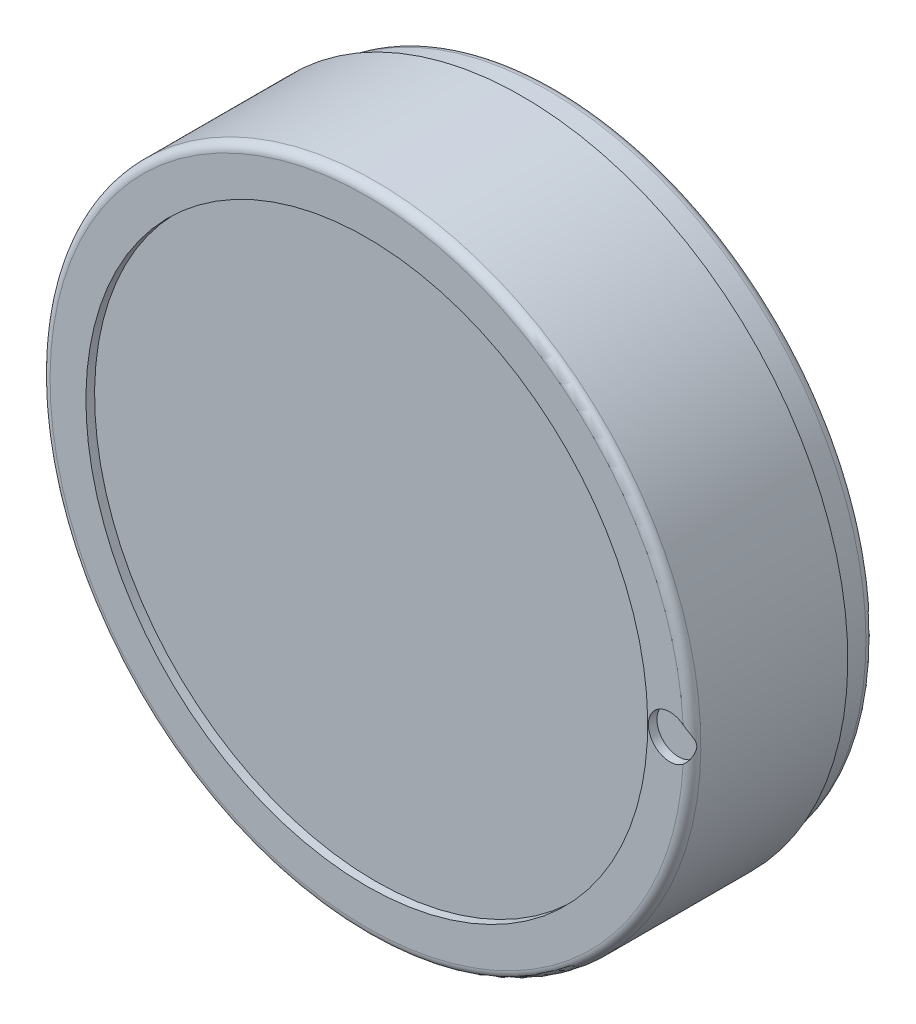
ISO-10303-21;
HEADER;
FILE_DESCRIPTION(('STEP AP214'),'2;1');
FILE_NAME('part.step','',(''),(''),'','','');
FILE_SCHEMA(('AUTOMOTIVE_DESIGN { 1 0 10303 214 1 1 1 1 }'));
ENDSEC;
DATA;
#1=APPLICATION_CONTEXT('core data for automotive mechanical design processes');
#2=APPLICATION_PROTOCOL_DEFINITION('international standard','automotive_design',2000,#1);
#3=PRODUCT_CONTEXT('',#1,'mechanical');
#4=PRODUCT('Part','Part','',(#3));
#5=PRODUCT_RELATED_PRODUCT_CATEGORY('part','',(#4));
#6=PRODUCT_DEFINITION_FORMATION('','',#4);
#7=PRODUCT_DEFINITION_CONTEXT('part definition',#1,'design');
#8=PRODUCT_DEFINITION('design','',#6,#7);
#9=PRODUCT_DEFINITION_SHAPE('','',#8);
#10=(LENGTH_UNIT() NAMED_UNIT(*) SI_UNIT(.MILLI.,.METRE.));
#11=(NAMED_UNIT(*) PLANE_ANGLE_UNIT() SI_UNIT($,.RADIAN.));
#12=(NAMED_UNIT(*) SI_UNIT($,.STERADIAN.) SOLID_ANGLE_UNIT());
#13=UNCERTAINTY_MEASURE_WITH_UNIT(LENGTH_MEASURE(1.E-05),#10,'distance_accuracy_value','');
#14=(GEOMETRIC_REPRESENTATION_CONTEXT(3) GLOBAL_UNCERTAINTY_ASSIGNED_CONTEXT((#13)) GLOBAL_UNIT_ASSIGNED_CONTEXT((#10,
#11,#12)) REPRESENTATION_CONTEXT('',''));
#15=CARTESIAN_POINT('',(0.,0.,0.));
#16=DIRECTION('',(0.,0.,1.));
#17=DIRECTION('',(1.,0.,0.));
#18=AXIS2_PLACEMENT_3D('',#15,#16,#17);
#19=CARTESIAN_POINT('',(0.,0.,22.));
#20=DIRECTION('',(0.,0.,1.));
#21=DIRECTION('',(0.,-1.,0.));
#22=AXIS2_PLACEMENT_3D('',#19,#20,#21);
#23=PLANE('',#22);
#24=CARTESIAN_POINT('',(0.,0.,22.));
#25=DIRECTION('',(0.,0.,1.));
#26=DIRECTION('',(0.,-1.,0.));
#27=AXIS2_PLACEMENT_3D('',#24,#25,#26);
#28=CIRCLE('',#27,32.5);
#29=CARTESIAN_POINT('',(0.,-32.5,22.));
#30=VERTEX_POINT('',#29);
#31=EDGE_CURVE('E124',#30,#30,#28,.T.);
#32=ORIENTED_EDGE('',*,*,#31,.F.);
#33=EDGE_LOOP('',(#32));
#34=FACE_BOUND('',#33,.T.);
#35=CARTESIAN_POINT('',(0.,0.,22.));
#36=DIRECTION('',(0.,0.,1.));
#37=DIRECTION('',(0.,-1.,0.));
#38=AXIS2_PLACEMENT_3D('',#35,#36,#37);
#39=CIRCLE('',#38,36.6499999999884);
#40=CARTESIAN_POINT('',(36.596484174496,1.97986011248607,22.));
#41=VERTEX_POINT('',#40);
#42=CARTESIAN_POINT('',(36.596484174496,-1.97986011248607,22.));
#43=VERTEX_POINT('',#42);
#44=EDGE_CURVE('E160',#41,#43,#39,.T.);
#45=ORIENTED_EDGE('',*,*,#44,.T.);
#46=CARTESIAN_POINT('',(35.07,0.,22.));
#47=DIRECTION('',(0.,0.,1.));
#48=DIRECTION('',(0.,-1.,0.));
#49=AXIS2_PLACEMENT_3D('',#46,#47,#48);
#50=CIRCLE('',#49,2.5);
#51=EDGE_CURVE('E42',#43,#41,#50,.F.);
#52=ORIENTED_EDGE('',*,*,#51,.T.);
#53=EDGE_LOOP('',(#45,#52));
#54=FACE_BOUND('',#53,.T.);
#55=ADVANCED_FACE('F14',(#34,#54),#23,.T.);
#56=CARTESIAN_POINT('',(0.,0.,21.));
#57=DIRECTION('',(0.,0.,1.));
#58=DIRECTION('',(0.,-1.,0.));
#59=AXIS2_PLACEMENT_3D('',#56,#57,#58);
#60=TOROIDAL_SURFACE('',#59,36.6499999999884,0.999999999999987);
#61=CARTESIAN_POINT('',(0.,0.,21.));
#62=DIRECTION('',(0.,0.,1.));
#63=DIRECTION('',(0.,-1.,0.));
#64=AXIS2_PLACEMENT_3D('',#61,#62,#63);
#65=CIRCLE('',#64,37.6499999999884);
#66=CARTESIAN_POINT('',(0.,-37.6499999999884,21.));
#67=VERTEX_POINT('',#66);
#68=EDGE_CURVE('E157',#67,#67,#65,.T.);
#69=ORIENTED_EDGE('',*,*,#68,.T.);
#70=EDGE_LOOP('',(#69));
#71=FACE_BOUND('',#70,.T.);
#72=ORIENTED_EDGE('',*,*,#44,.F.);
#73=CARTESIAN_POINT('',(35.5656886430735,2.45036584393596,20.9998));
#74=CARTESIAN_POINT('',(35.5656830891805,2.45036441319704,21.0268327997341));
#75=CARTESIAN_POINT('',(35.5667927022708,2.45014279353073,21.0538529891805));
#76=CARTESIAN_POINT('',(35.5712286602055,2.44924016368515,21.1077024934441));
#77=CARTESIAN_POINT('',(35.5745549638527,2.44855916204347,21.1345318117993));
#78=CARTESIAN_POINT('',(35.5878267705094,2.44580100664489,21.2144154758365));
#79=CARTESIAN_POINT('',(35.6010652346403,2.44300879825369,21.2669384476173));
#80=CARTESIAN_POINT('',(35.6358946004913,2.43517519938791,21.3689742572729));
#81=CARTESIAN_POINT('',(35.6574913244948,2.4301322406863,21.4184849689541));
#82=CARTESIAN_POINT('',(35.7082565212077,2.41729410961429,21.5130505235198));
#83=CARTESIAN_POINT('',(35.7374215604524,2.40950018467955,21.5581073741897));
#84=CARTESIAN_POINT('',(35.8020378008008,2.39065747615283,21.6423180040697));
#85=CARTESIAN_POINT('',(35.8374568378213,2.37962516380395,21.6815001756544));
#86=CARTESIAN_POINT('',(35.9132468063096,2.35383380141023,21.7532924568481));
#87=CARTESIAN_POINT('',(35.9536181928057,2.33907440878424,21.7859019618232));
#88=CARTESIAN_POINT('',(36.0380877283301,2.30540460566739,21.8443038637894));
#89=CARTESIAN_POINT('',(36.0822191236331,2.28645414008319,21.8700247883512));
#90=CARTESIAN_POINT('',(36.1721479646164,2.24448967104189,21.9141587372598));
#91=CARTESIAN_POINT('',(36.2179457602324,2.22147481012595,21.9325702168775));
#92=CARTESIAN_POINT('',(36.3132353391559,2.16968319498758,21.96360913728));
#93=CARTESIAN_POINT('',(36.3627392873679,2.14059874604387,21.9756801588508));
#94=CARTESIAN_POINT('',(36.4604470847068,2.07846642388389,21.992615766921));
#95=CARTESIAN_POINT('',(36.5086501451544,2.04541620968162,21.9974760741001));
#96=CARTESIAN_POINT('',(36.6270611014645,1.95790844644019,22.0019087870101));
#97=CARTESIAN_POINT('',(36.6957729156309,1.90121196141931,21.997452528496));
#98=CARTESIAN_POINT('',(36.8259522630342,1.78171283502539,21.9777587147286));
#99=CARTESIAN_POINT('',(36.8874031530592,1.71889674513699,21.9624969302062));
#100=CARTESIAN_POINT('',(37.0273939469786,1.56017793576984,21.9157988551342));
#101=CARTESIAN_POINT('',(37.1017074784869,1.46178792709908,21.8802120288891));
#102=CARTESIAN_POINT('',(37.2339286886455,1.25788809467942,21.7996598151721));
#103=CARTESIAN_POINT('',(37.2917848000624,1.15235714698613,21.7546656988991));
#104=CARTESIAN_POINT('',(37.3677118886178,0.987127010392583,21.6835732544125));
#105=CARTESIAN_POINT('',(37.3916162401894,0.929506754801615,21.6586681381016));
#106=CARTESIAN_POINT('',(37.4350713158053,0.812606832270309,21.6089674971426));
#107=CARTESIAN_POINT('',(37.4546231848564,0.753327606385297,21.5841719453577));
#108=CARTESIAN_POINT('',(37.4893131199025,0.633105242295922,21.5361620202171));
#109=CARTESIAN_POINT('',(37.5044663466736,0.572168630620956,21.5129424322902));
#110=CARTESIAN_POINT('',(37.5303161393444,0.448176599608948,21.4701204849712));
#111=CARTESIAN_POINT('',(37.5410185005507,0.385124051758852,21.4505134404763));
#112=CARTESIAN_POINT('',(37.5585924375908,0.249149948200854,21.4165288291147));
#113=CARTESIAN_POINT('',(37.5648988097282,0.175915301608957,21.4029858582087));
#114=CARTESIAN_POINT('',(37.5694238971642,0.0651450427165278,21.393189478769));
#115=CARTESIAN_POINT('',(37.5701145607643,0.0281693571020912,21.3916671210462));
#116=CARTESIAN_POINT('',(37.5698545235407,-0.0457521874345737,21.3922373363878));
#117=CARTESIAN_POINT('',(37.5689036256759,-0.0826980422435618,21.394330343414));
#118=CARTESIAN_POINT('',(37.5636604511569,-0.192252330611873,21.4056182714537));
#119=CARTESIAN_POINT('',(37.5570032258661,-0.26423639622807,21.4197703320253));
#120=CARTESIAN_POINT('',(37.5379108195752,-0.40570987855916,21.456327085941));
#121=CARTESIAN_POINT('',(37.5254228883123,-0.475170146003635,21.4788067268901));
#122=CARTESIAN_POINT('',(37.4942712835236,-0.615057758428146,21.5288377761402));
#123=CARTESIAN_POINT('',(37.4753179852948,-0.685344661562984,21.5565933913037));
#124=CARTESIAN_POINT('',(37.4315596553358,-0.823587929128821,21.6133961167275));
#125=CARTESIAN_POINT('',(37.4067494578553,-0.89154217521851,21.6424443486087));
#126=CARTESIAN_POINT('',(37.3513133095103,-1.02509454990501,21.6998724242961));
#127=CARTESIAN_POINT('',(37.3207030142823,-1.09069846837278,21.7282538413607));
#128=CARTESIAN_POINT('',(37.2535369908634,-1.21960791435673,21.7829882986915));
#129=CARTESIAN_POINT('',(37.2169856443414,-1.28291509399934,21.8093428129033));
#130=CARTESIAN_POINT('',(37.1246961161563,-1.42752068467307,21.8668975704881));
#131=CARTESIAN_POINT('',(37.066607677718,-1.50785744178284,21.8968244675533));
#132=CARTESIAN_POINT('',(36.939571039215,-1.66273591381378,21.9473075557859));
#133=CARTESIAN_POINT('',(36.8706367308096,-1.73728486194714,21.9678756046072));
#134=CARTESIAN_POINT('',(36.741003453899,-1.86109666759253,21.9918916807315));
#135=CARTESIAN_POINT('',(36.6824881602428,-1.91205157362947,21.998316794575));
#136=CARTESIAN_POINT('',(36.5607787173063,-2.00837375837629,22.0011043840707));
#137=CARTESIAN_POINT('',(36.4975918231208,-2.05374942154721,21.9974821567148));
#138=CARTESIAN_POINT('',(36.3812743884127,-2.12941143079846,21.979749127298));
#139=CARTESIAN_POINT('',(36.3286044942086,-2.16091133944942,21.9678367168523));
#140=CARTESIAN_POINT('',(36.2232967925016,-2.21889826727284,21.9349298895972));
#141=CARTESIAN_POINT('',(36.1706589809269,-2.24538743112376,21.9139393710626));
#142=CARTESIAN_POINT('',(36.0673577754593,-2.29315042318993,21.8621310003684));
#143=CARTESIAN_POINT('',(36.0167093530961,-2.31438941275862,21.8312504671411));
#144=CARTESIAN_POINT('',(35.9204260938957,-2.35147644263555,21.7599007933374));
#145=CARTESIAN_POINT('',(35.8747890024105,-2.3673269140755,21.7194359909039));
#146=CARTESIAN_POINT('',(35.7957117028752,-2.39267194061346,21.6349719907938));
#147=CARTESIAN_POINT('',(35.7614801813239,-2.40267637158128,21.5918621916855));
#148=CARTESIAN_POINT('',(35.7004150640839,-2.41941787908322,21.5000964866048));
#149=CARTESIAN_POINT('',(35.6735828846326,-2.42615433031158,21.4514395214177));
#150=CARTESIAN_POINT('',(35.6291877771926,-2.43676299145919,21.351845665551));
#151=CARTESIAN_POINT('',(35.6113351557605,-2.44072659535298,21.301046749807));
#152=CARTESIAN_POINT('',(35.5841576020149,-2.44659731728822,21.197153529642));
#153=CARTESIAN_POINT('',(35.5748185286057,-2.44850784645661,21.1440631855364));
#154=CARTESIAN_POINT('',(35.5684732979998,-2.44980089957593,21.0755169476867));
#155=CARTESIAN_POINT('',(35.5674258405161,-2.45001376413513,21.0603806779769));
#156=CARTESIAN_POINT('',(35.5660329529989,-2.45029639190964,21.0300981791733));
#157=CARTESIAN_POINT('',(35.5656864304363,-2.45036637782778,21.014952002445));
#158=CARTESIAN_POINT('',(35.5656886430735,-2.45036584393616,20.9998));
#159=B_SPLINE_CURVE_WITH_KNOTS('',3,(#73,#74,#75,#76,#77,#78,#79,#80,#81,#82,#83,#84,#85,#86,
#87,#88,#89,#90,#91,#92,#93,#94,#95,#96,#97,#98,#99,#100,#101,#102,#103,#104,#105,#106,#107,
#108,#109,#110,#111,#112,#113,#114,#115,#116,#117,#118,#119,#120,#121,#122,#123,#124,#125,#126,
#127,#128,#129,#130,#131,#132,#133,#134,#135,#136,#137,#138,#139,#140,#141,#142,#143,#144,#145,
#146,#147,#148,#149,#150,#151,#152,#153,#154,#155,#156,#157,#158),.UNSPECIFIED.,.F.,.F.,(4,2,2,
2,2,2,2,2,2,2,2,2,2,2,2,2,2,2,2,2,2,2,2,2,2,2,2,2,2,2,2,2,2,2,2,2,2,2,2,2,2,2,4),(0.,
0.0810489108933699,0.162096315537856,0.323975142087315,0.485966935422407,0.647885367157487,
0.808994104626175,0.970117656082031,1.13285331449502,1.29562334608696,1.47096227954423,
1.6464052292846,1.91247923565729,2.17915175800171,2.56206144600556,2.9461580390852,
3.14753670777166,3.34886233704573,3.54948558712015,3.74984678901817,3.97270970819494,
4.08354588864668,4.194395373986,4.41415083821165,4.63593413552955,4.86935276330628,
5.10297803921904,5.33598147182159,5.56881383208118,5.87852594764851,6.18784455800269,
6.42061560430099,6.65303245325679,6.83982769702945,7.02654280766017,7.21446551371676,
7.4023033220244,7.56931344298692,7.73635550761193,7.89759312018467,8.05856242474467,
8.10407342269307,8.14951342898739),.UNSPECIFIED.);
#160=EDGE_CURVE('E166',#41,#43,#159,.T.);
#161=ORIENTED_EDGE('',*,*,#160,.T.);
#162=EDGE_LOOP('',(#72,#161));
#163=FACE_BOUND('',#162,.T.);
#164=ADVANCED_FACE('F180',(#71,#163),#60,.T.);
#165=CARTESIAN_POINT('',(0.,0.,34.9460135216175));
#166=DIRECTION('',(0.,0.,1.));
#167=DIRECTION('',(0.,-1.,0.));
#168=AXIS2_PLACEMENT_3D('',#165,#166,#167);
#169=CYLINDRICAL_SURFACE('',#168,37.6499999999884);
#170=CARTESIAN_POINT('',(0.,0.,4.));
#171=DIRECTION('',(0.,0.,1.));
#172=DIRECTION('',(0.,-1.,0.));
#173=AXIS2_PLACEMENT_3D('',#170,#171,#172);
#174=CIRCLE('',#173,37.6499999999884);
#175=CARTESIAN_POINT('',(0.,-37.6499999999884,4.));
#176=VERTEX_POINT('',#175);
#177=EDGE_CURVE('E154',#176,#176,#174,.T.);
#178=ORIENTED_EDGE('',*,*,#177,.T.);
#179=EDGE_LOOP('',(#178));
#180=FACE_BOUND('',#179,.T.);
#181=ORIENTED_EDGE('',*,*,#68,.F.);
#182=EDGE_LOOP('',(#181));
#183=FACE_BOUND('',#182,.T.);
#184=ADVANCED_FACE('F274',(#180,#183),#169,.T.);
#185=CARTESIAN_POINT('',(-37.6499999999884,0.,4.));
#186=DIRECTION('',(0.,0.,-1.));
#187=DIRECTION('',(0.,1.,0.));
#188=AXIS2_PLACEMENT_3D('',#185,#186,#187);
#189=PLANE('',#188);
#190=CARTESIAN_POINT('',(0.,0.,4.));
#191=DIRECTION('',(0.,0.,1.));
#192=DIRECTION('',(0.,-1.,0.));
#193=AXIS2_PLACEMENT_3D('',#190,#191,#192);
#194=CIRCLE('',#193,36.75);
#195=CARTESIAN_POINT('',(0.,-36.75,4.));
#196=VERTEX_POINT('',#195);
#197=EDGE_CURVE('E151',#196,#196,#194,.T.);
#198=ORIENTED_EDGE('',*,*,#197,.T.);
#199=EDGE_LOOP('',(#198));
#200=FACE_BOUND('',#199,.T.);
#201=ORIENTED_EDGE('',*,*,#177,.F.);
#202=EDGE_LOOP('',(#201));
#203=FACE_BOUND('',#202,.T.);
#204=ADVANCED_FACE('F380',(#200,#203),#189,.T.);
#205=CARTESIAN_POINT('',(0.,0.,34.9460135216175));
#206=DIRECTION('',(0.,0.,1.));
#207=DIRECTION('',(0.,-1.,0.));
#208=AXIS2_PLACEMENT_3D('',#205,#206,#207);
#209=CYLINDRICAL_SURFACE('',#208,36.75);
#210=ORIENTED_EDGE('',*,*,#197,.F.);
#211=EDGE_LOOP('',(#210));
#212=FACE_BOUND('',#211,.T.);
#213=CARTESIAN_POINT('',(0.,0.,1.));
#214=DIRECTION('',(0.,0.,1.));
#215=DIRECTION('',(0.,-1.,0.));
#216=AXIS2_PLACEMENT_3D('',#213,#214,#215);
#217=CIRCLE('',#216,36.75);
#218=CARTESIAN_POINT('',(0.,-36.75,1.));
#219=VERTEX_POINT('',#218);
#220=EDGE_CURVE('E148',#219,#219,#217,.T.);
#221=ORIENTED_EDGE('',*,*,#220,.T.);
#222=EDGE_LOOP('',(#221));
#223=FACE_BOUND('',#222,.T.);
#224=ADVANCED_FACE('F387',(#212,#223),#209,.T.);
#225=CARTESIAN_POINT('',(0.,0.,1.));
#226=DIRECTION('',(0.,0.,1.));
#227=DIRECTION('',(0.,-1.,0.));
#228=AXIS2_PLACEMENT_3D('',#225,#226,#227);
#229=TOROIDAL_SURFACE('',#228,35.75,1.);
#230=CARTESIAN_POINT('',(0.,0.,0.));
#231=DIRECTION('',(0.,0.,1.));
#232=DIRECTION('',(0.,-1.,0.));
#233=AXIS2_PLACEMENT_3D('',#230,#231,#232);
#234=CIRCLE('',#233,35.75);
#235=CARTESIAN_POINT('',(0.,-35.75,0.));
#236=VERTEX_POINT('',#235);
#237=EDGE_CURVE('E145',#236,#236,#234,.T.);
#238=ORIENTED_EDGE('',*,*,#237,.T.);
#239=EDGE_LOOP('',(#238));
#240=FACE_BOUND('',#239,.T.);
#241=ORIENTED_EDGE('',*,*,#220,.F.);
#242=EDGE_LOOP('',(#241));
#243=FACE_BOUND('',#242,.T.);
#244=ADVANCED_FACE('F396',(#240,#243),#229,.T.);
#245=CARTESIAN_POINT('',(-35.75,0.,0.));
#246=DIRECTION('',(0.,0.,-1.));
#247=DIRECTION('',(0.,1.,0.));
#248=AXIS2_PLACEMENT_3D('',#245,#246,#247);
#249=PLANE('',#248);
#250=CARTESIAN_POINT('',(0.,0.,0.));
#251=DIRECTION('',(0.,0.,1.));
#252=DIRECTION('',(0.,-1.,0.));
#253=AXIS2_PLACEMENT_3D('',#250,#251,#252);
#254=CIRCLE('',#253,4.50000000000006);
#255=CARTESIAN_POINT('',(0.,-4.50000000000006,0.));
#256=VERTEX_POINT('',#255);
#257=EDGE_CURVE('E142',#256,#256,#254,.T.);
#258=ORIENTED_EDGE('',*,*,#257,.T.);
#259=EDGE_LOOP('',(#258));
#260=FACE_BOUND('',#259,.T.);
#261=ORIENTED_EDGE('',*,*,#237,.F.);
#262=EDGE_LOOP('',(#261));
#263=FACE_BOUND('',#262,.T.);
#264=ADVANCED_FACE('F405',(#260,#263),#249,.T.);
#265=CARTESIAN_POINT('',(0.,0.,34.9460135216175));
#266=DIRECTION('',(0.,0.,1.));
#267=DIRECTION('',(0.,-1.,0.));
#268=AXIS2_PLACEMENT_3D('',#265,#266,#267);
#269=CYLINDRICAL_SURFACE('',#268,4.50000000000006);
#270=CARTESIAN_POINT('',(0.,0.,-0.5));
#271=DIRECTION('',(0.,0.,1.));
#272=DIRECTION('',(0.,-1.,0.));
#273=AXIS2_PLACEMENT_3D('',#270,#271,#272);
#274=CIRCLE('',#273,4.50000000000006);
#275=CARTESIAN_POINT('',(0.,-4.50000000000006,-0.5));
#276=VERTEX_POINT('',#275);
#277=EDGE_CURVE('E139',#276,#276,#274,.T.);
#278=ORIENTED_EDGE('',*,*,#277,.T.);
#279=EDGE_LOOP('',(#278));
#280=FACE_BOUND('',#279,.T.);
#281=ORIENTED_EDGE('',*,*,#257,.F.);
#282=EDGE_LOOP('',(#281));
#283=FACE_BOUND('',#282,.T.);
#284=ADVANCED_FACE('F414',(#280,#283),#269,.T.);
#285=CARTESIAN_POINT('',(-4.04160091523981,0.,-0.5));
#286=DIRECTION('',(0.,0.,1.));
#287=DIRECTION('',(0.,-1.,0.));
#288=AXIS2_PLACEMENT_3D('',#285,#286,#287);
#289=PLANE('',#288);
#290=ORIENTED_EDGE('',*,*,#277,.F.);
#291=EDGE_LOOP('',(#290));
#292=FACE_BOUND('',#291,.T.);
#293=DIRECTION('',(0.5,0.866025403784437,0.));
#294=VECTOR('',#293,1.);
#295=CARTESIAN_POINT('',(2.0207374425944,-3.50001991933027,-0.5));
#296=LINE('',#295,#294);
#297=CARTESIAN_POINT('',(2.0207374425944,-3.50001991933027,-0.5));
#298=VERTEX_POINT('',#297);
#299=CARTESIAN_POINT('',(4.0414748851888,0.,-0.5));
#300=VERTEX_POINT('',#299);
#301=EDGE_CURVE('E97',#298,#300,#296,.T.);
#302=ORIENTED_EDGE('',*,*,#301,.T.);
#303=DIRECTION('',(0.5,-0.866025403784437,0.));
#304=VECTOR('',#303,1.);
#305=CARTESIAN_POINT('',(2.0207374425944,3.50001991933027,-0.5));
#306=LINE('',#305,#304);
#307=CARTESIAN_POINT('',(2.0207374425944,3.50001991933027,-0.5));
#308=VERTEX_POINT('',#307);
#309=EDGE_CURVE('E80',#308,#300,#306,.T.);
#310=ORIENTED_EDGE('',*,*,#309,.F.);
#311=DIRECTION('',(-1.,0.,0.));
#312=VECTOR('',#311,1.);
#313=CARTESIAN_POINT('',(2.0207374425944,3.50001991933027,-0.5));
#314=LINE('',#313,#312);
#315=CARTESIAN_POINT('',(-2.0207374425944,3.50001991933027,-0.5));
#316=VERTEX_POINT('',#315);
#317=EDGE_CURVE('E93',#308,#316,#314,.T.);
#318=ORIENTED_EDGE('',*,*,#317,.T.);
#319=DIRECTION('',(-0.5,-0.866025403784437,0.));
#320=VECTOR('',#319,1.);
#321=CARTESIAN_POINT('',(-2.0207374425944,3.50001991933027,-0.5));
#322=LINE('',#321,#320);
#323=CARTESIAN_POINT('',(-4.0414748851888,0.,-0.5));
#324=VERTEX_POINT('',#323);
#325=EDGE_CURVE('E101',#316,#324,#322,.T.);
#326=ORIENTED_EDGE('',*,*,#325,.T.);
#327=DIRECTION('',(-0.5,0.866025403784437,0.));
#328=VECTOR('',#327,1.);
#329=CARTESIAN_POINT('',(-2.0207374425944,-3.50001991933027,-0.5));
#330=LINE('',#329,#328);
#331=CARTESIAN_POINT('',(-2.0207374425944,-3.50001991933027,-0.5));
#332=VERTEX_POINT('',#331);
#333=EDGE_CURVE('E103',#332,#324,#330,.T.);
#334=ORIENTED_EDGE('',*,*,#333,.F.);
#335=DIRECTION('',(-1.,0.,0.));
#336=VECTOR('',#335,1.);
#337=CARTESIAN_POINT('',(2.0207374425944,-3.50001991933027,-0.5));
#338=LINE('',#337,#336);
#339=EDGE_CURVE('E109',#298,#332,#338,.T.);
#340=ORIENTED_EDGE('',*,*,#339,.F.);
#341=EDGE_LOOP('',(#302,#310,#318,#326,#334,#340));
#342=FACE_BOUND('',#341,.T.);
#343=ADVANCED_FACE('F91',(#292,#342),#289,.F.);
#344=CARTESIAN_POINT('',(0.,0.,21.));
#345=DIRECTION('',(0.,0.,1.));
#346=DIRECTION('',(0.,-1.,0.));
#347=AXIS2_PLACEMENT_3D('',#344,#345,#346);
#348=CYLINDRICAL_SURFACE('',#347,32.5);
#349=CARTESIAN_POINT('',(0.,0.,21.));
#350=DIRECTION('',(0.,0.,1.));
#351=DIRECTION('',(0.,-1.,0.));
#352=AXIS2_PLACEMENT_3D('',#349,#350,#351);
#353=CIRCLE('',#352,32.5);
#354=CARTESIAN_POINT('',(0.,-32.5,21.));
#355=VERTEX_POINT('',#354);
#356=EDGE_CURVE('E127',#355,#355,#353,.T.);
#357=ORIENTED_EDGE('',*,*,#356,.F.);
#358=EDGE_LOOP('',(#357));
#359=FACE_BOUND('',#358,.T.);
#360=ORIENTED_EDGE('',*,*,#31,.T.);
#361=EDGE_LOOP('',(#360));
#362=FACE_BOUND('',#361,.T.);
#363=ADVANCED_FACE('F191',(#359,#362),#348,.F.);
#364=CARTESIAN_POINT('',(0.,0.,21.));
#365=DIRECTION('',(0.,0.,1.));
#366=DIRECTION('',(0.,-1.,0.));
#367=AXIS2_PLACEMENT_3D('',#364,#365,#366);
#368=PLANE('',#367);
#369=ORIENTED_EDGE('',*,*,#356,.T.);
#370=EDGE_LOOP('',(#369));
#371=FACE_BOUND('',#370,.T.);
#372=ADVANCED_FACE('F190',(#371),#368,.T.);
#373=CARTESIAN_POINT('',(35.07,0.,31.));
#374=DIRECTION('',(0.,0.,-1.));
#375=DIRECTION('',(0.,1.,0.));
#376=AXIS2_PLACEMENT_3D('',#373,#374,#375);
#377=CYLINDRICAL_SURFACE('',#376,2.5);
#378=ORIENTED_EDGE('',*,*,#160,.F.);
#379=ORIENTED_EDGE('',*,*,#51,.F.);
#380=EDGE_LOOP('',(#378,#379));
#381=FACE_BOUND('',#380,.T.);
#382=CARTESIAN_POINT('',(35.07,0.,21.));
#383=DIRECTION('',(0.,0.,1.));
#384=DIRECTION('',(0.,-1.,0.));
#385=AXIS2_PLACEMENT_3D('',#382,#383,#384);
#386=CIRCLE('',#385,2.5);
#387=CARTESIAN_POINT('',(35.07,-2.5,21.));
#388=VERTEX_POINT('',#387);
#389=EDGE_CURVE('E120',#388,#388,#386,.T.);
#390=ORIENTED_EDGE('',*,*,#389,.F.);
#391=EDGE_LOOP('',(#390));
#392=FACE_BOUND('',#391,.T.);
#393=ADVANCED_FACE('F184',(#381,#392),#377,.F.);
#394=CARTESIAN_POINT('',(35.07,0.,21.));
#395=DIRECTION('',(0.,0.,1.));
#396=DIRECTION('',(0.,-1.,0.));
#397=AXIS2_PLACEMENT_3D('',#394,#395,#396);
#398=PLANE('',#397);
#399=ORIENTED_EDGE('',*,*,#389,.T.);
#400=EDGE_LOOP('',(#399));
#401=FACE_BOUND('',#400,.T.);
#402=ADVANCED_FACE('F189',(#401),#398,.T.);
#403=CARTESIAN_POINT('',(2.0207374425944,-3.50001991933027,-10.5));
#404=DIRECTION('',(0.866025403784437,-0.5,0.));
#405=DIRECTION('',(-0.5,-0.866025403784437,0.));
#406=AXIS2_PLACEMENT_3D('',#403,#404,#405);
#407=PLANE('',#406);
#408=DIRECTION('',(0.,0.,1.));
#409=VECTOR('',#408,1.);
#410=CARTESIAN_POINT('',(4.0414748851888,0.,-10.5));
#411=LINE('',#410,#409);
#412=CARTESIAN_POINT('',(4.0414748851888,0.,-2.52877022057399));
#413=VERTEX_POINT('',#412);
#414=EDGE_CURVE('E35',#413,#300,#411,.T.);
#415=ORIENTED_EDGE('',*,*,#414,.T.);
#416=ORIENTED_EDGE('',*,*,#301,.F.);
#417=DIRECTION('',(0.,0.,1.));
#418=VECTOR('',#417,1.);
#419=CARTESIAN_POINT('',(2.0207374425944,-3.50001991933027,-10.5));
#420=LINE('',#419,#418);
#421=CARTESIAN_POINT('',(2.0207374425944,-3.50001991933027,-2.52877022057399));
#422=VERTEX_POINT('',#421);
#423=EDGE_CURVE('E118',#422,#298,#420,.T.);
#424=ORIENTED_EDGE('',*,*,#423,.F.);
#425=CARTESIAN_POINT('',(4.04159035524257,0.000199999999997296,-2.52870356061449));
#426=CARTESIAN_POINT('',(3.95279035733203,-0.15360610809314,-2.57998412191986));
#427=CARTESIAN_POINT('',(3.86322406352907,-0.308739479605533,-2.62662187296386));
#428=CARTESIAN_POINT('',(3.68254099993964,-0.621691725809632,-2.70802866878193));
#429=CARTESIAN_POINT('',(3.59142102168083,-0.77951615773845,-2.74276892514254));
#430=CARTESIAN_POINT('',(3.41031000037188,-1.09320964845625,-2.79684791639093));
#431=CARTESIAN_POINT('',(3.3203468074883,-1.24903046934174,-2.81654645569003));
#432=CARTESIAN_POINT('',(3.13999719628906,-1.56140515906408,-2.84006339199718));
#433=CARTESIAN_POINT('',(3.04961143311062,-1.71795789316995,-2.8439012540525));
#434=CARTESIAN_POINT('',(2.88071728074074,-2.01049114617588,-2.83592174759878));
#435=CARTESIAN_POINT('',(2.8021836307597,-2.14651541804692,-2.82606363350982));
#436=CARTESIAN_POINT('',(2.64562782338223,-2.41767803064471,-2.79481768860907));
#437=CARTESIAN_POINT('',(2.56760620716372,-2.55281543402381,-2.77341918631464));
#438=CARTESIAN_POINT('',(2.41072766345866,-2.82453704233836,-2.71992400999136));
#439=CARTESIAN_POINT('',(2.33189058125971,-2.96108687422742,-2.68760061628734));
#440=CARTESIAN_POINT('',(2.17539195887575,-3.23215043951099,-2.6142387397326));
#441=CARTESIAN_POINT('',(2.09772841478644,-3.36666764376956,-2.57321749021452));
#442=CARTESIAN_POINT('',(2.0206219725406,-3.50021991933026,-2.52870356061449));
#443=B_SPLINE_CURVE_WITH_KNOTS('',3,(#425,#426,#427,#428,#429,#430,#431,#432,#433,#434,#435,
#436,#437,#438,#439,#440,#441,#442),.UNSPECIFIED.,.F.,.F.,(4,2,2,2,2,2,2,2,4),(0.,
0.554783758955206,1.11090059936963,1.6532577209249,2.19494903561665,2.6666293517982,
3.13874658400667,3.62133350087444,4.10297304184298),.UNSPECIFIED.);
#444=EDGE_CURVE('E9',#413,#422,#443,.T.);
#445=ORIENTED_EDGE('',*,*,#444,.F.);
#446=EDGE_LOOP('',(#415,#416,#424,#445));
#447=FACE_BOUND('',#446,.T.);
#448=ADVANCED_FACE('F245',(#447),#407,.T.);
#449=CARTESIAN_POINT('',(2.0207374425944,-3.50001991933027,-10.5));
#450=DIRECTION('',(0.,1.,0.));
#451=DIRECTION('',(0.,0.,1.));
#452=AXIS2_PLACEMENT_3D('',#449,#450,#451);
#453=PLANE('',#452);
#454=CARTESIAN_POINT('',(-5.3512905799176,-3.50001991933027,-1.170588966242));
#455=CARTESIAN_POINT('',(-5.19768019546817,-3.50001991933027,-1.244778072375));
#456=CARTESIAN_POINT('',(-5.04370579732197,-3.50001991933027,-1.31822716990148));
#457=CARTESIAN_POINT('',(-4.73483211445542,-3.50001991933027,-1.46322230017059));
#458=CARTESIAN_POINT('',(-4.57993267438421,-3.50001991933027,-1.53476800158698));
#459=CARTESIAN_POINT('',(-4.26817155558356,-3.50001991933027,-1.67591184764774));
#460=CARTESIAN_POINT('',(-4.11130371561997,-3.50001991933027,-1.74549643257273));
#461=CARTESIAN_POINT('',(-3.79627605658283,-3.50001991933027,-1.88166504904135));
#462=CARTESIAN_POINT('',(-3.63811630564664,-3.50001991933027,-1.94824923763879));
#463=CARTESIAN_POINT('',(-3.31832834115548,-3.50001991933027,-2.07839366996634));
#464=CARTESIAN_POINT('',(-3.15668129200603,-3.50001991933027,-2.14190788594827));
#465=CARTESIAN_POINT('',(-2.83147819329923,-3.50001991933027,-2.26394169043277));
#466=CARTESIAN_POINT('',(-2.66792193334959,-3.50001991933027,-2.3224607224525));
#467=CARTESIAN_POINT('',(-2.33897882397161,-3.50001991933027,-2.43292598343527));
#468=CARTESIAN_POINT('',(-2.17359673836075,-3.50001991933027,-2.48488625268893));
#469=CARTESIAN_POINT('',(-1.84048250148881,-3.50001991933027,-2.58054136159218));
#470=CARTESIAN_POINT('',(-1.67275111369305,-3.50001991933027,-2.62423882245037));
#471=CARTESIAN_POINT('',(-1.3348205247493,-3.50001991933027,-2.70124276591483));
#472=CARTESIAN_POINT('',(-1.16462058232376,-3.50001991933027,-2.73454605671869));
#473=CARTESIAN_POINT('',(-0.82217825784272,-3.50001991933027,-2.78851273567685));
#474=CARTESIAN_POINT('',(-0.649935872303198,-3.50001991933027,-2.80917610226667));
#475=CARTESIAN_POINT('',(-0.30539419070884,-3.50001991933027,-2.83603499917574));
#476=CARTESIAN_POINT('',(-0.133102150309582,-3.50001991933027,-2.84232124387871));
#477=CARTESIAN_POINT('',(0.211348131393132,-3.50001991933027,-2.8400954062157));
#478=CARTESIAN_POINT('',(0.383506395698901,-3.50001991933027,-2.83158712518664));
#479=CARTESIAN_POINT('',(0.677767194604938,-3.50001991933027,-2.80499703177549));
#480=CARTESIAN_POINT('',(0.80019463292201,-3.50001991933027,-2.79032195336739));
#481=CARTESIAN_POINT('',(1.04409849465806,-3.50001991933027,-2.75444891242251));
#482=CARTESIAN_POINT('',(1.16557476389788,-3.50001991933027,-2.7332499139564));
#483=CARTESIAN_POINT('',(1.52848072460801,-3.50001991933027,-2.66098055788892));
#484=CARTESIAN_POINT('',(1.76820324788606,-3.50001991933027,-2.60125663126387));
#485=CARTESIAN_POINT('',(2.12689599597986,-3.50001991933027,-2.49831685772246));
#486=CARTESIAN_POINT('',(2.24773740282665,-3.50001991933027,-2.46125595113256));
#487=CARTESIAN_POINT('',(2.48815890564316,-3.50001991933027,-2.38348396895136));
#488=CARTESIAN_POINT('',(2.60773981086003,-3.50001991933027,-2.34277541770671));
#489=CARTESIAN_POINT('',(2.84514008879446,-3.50001991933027,-2.25855396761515));
#490=CARTESIAN_POINT('',(2.96296559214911,-3.50001991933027,-2.21505817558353));
#491=CARTESIAN_POINT('',(3.19770407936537,-3.50001991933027,-2.12552475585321));
#492=CARTESIAN_POINT('',(3.31461666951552,-3.50001991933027,-2.07948609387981));
#493=CARTESIAN_POINT('',(3.43110737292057,-3.50001991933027,-2.032427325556));
#494=B_SPLINE_CURVE_WITH_KNOTS('',3,(#454,#455,#456,#457,#458,#459,#460,#461,#462,#463,#464,
#465,#466,#467,#468,#469,#470,#471,#472,#473,#474,#475,#476,#477,#478,#479,#480,#481,#482,#483,
#484,#485,#486,#487,#488,#489,#490,#491,#492,#493),.UNSPECIFIED.,.F.,.F.,(4,2,2,2,2,2,2,2,2,2,2,
2,2,2,2,2,2,2,2,4),(0.,0.511770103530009,1.02362871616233,1.53842973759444,2.05320378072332,
2.57417206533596,3.0951983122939,3.61508957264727,4.13481563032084,4.65470112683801,
5.17458751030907,5.69118444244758,6.20764865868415,6.57737942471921,6.94716893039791,
7.68730127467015,8.06646189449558,8.44536211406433,8.82212587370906,9.19904402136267),.UNSPECIFIED.);
#495=CARTESIAN_POINT('',(-2.0207374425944,-3.50001991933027,-2.52877022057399));
#496=VERTEX_POINT('',#495);
#497=EDGE_CURVE('E28',#496,#422,#494,.T.);
#498=ORIENTED_EDGE('',*,*,#497,.T.);
#499=ORIENTED_EDGE('',*,*,#423,.T.);
#500=ORIENTED_EDGE('',*,*,#339,.T.);
#501=DIRECTION('',(0.,0.,1.));
#502=VECTOR('',#501,1.);
#503=CARTESIAN_POINT('',(-2.0207374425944,-3.50001991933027,-10.5));
#504=LINE('',#503,#502);
#505=EDGE_CURVE('E116',#496,#332,#504,.T.);
#506=ORIENTED_EDGE('',*,*,#505,.F.);
#507=EDGE_LOOP('',(#498,#499,#500,#506));
#508=FACE_BOUND('',#507,.T.);
#509=ADVANCED_FACE('F241',(#508),#453,.F.);
#510=CARTESIAN_POINT('',(-2.0207374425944,-3.50001991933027,-10.5));
#511=DIRECTION('',(0.866025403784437,0.5,0.));
#512=DIRECTION('',(0.5,-0.866025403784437,0.));
#513=AXIS2_PLACEMENT_3D('',#510,#511,#512);
#514=PLANE('',#513);
#515=CARTESIAN_POINT('',(-4.04159035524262,0.000199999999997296,-2.52870356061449));
#516=CARTESIAN_POINT('',(-3.95279035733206,-0.153606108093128,-2.57998412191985));
#517=CARTESIAN_POINT('',(-3.86322406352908,-0.308739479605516,-2.62662187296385));
#518=CARTESIAN_POINT('',(-3.68254099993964,-0.621691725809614,-2.70802866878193));
#519=CARTESIAN_POINT('',(-3.59142102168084,-0.779516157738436,-2.74276892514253));
#520=CARTESIAN_POINT('',(-3.41031000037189,-1.09320964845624,-2.79684791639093));
#521=CARTESIAN_POINT('',(-3.32034680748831,-1.24903046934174,-2.81654645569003));
#522=CARTESIAN_POINT('',(-3.13999719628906,-1.56140515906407,-2.84006339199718));
#523=CARTESIAN_POINT('',(-3.04961143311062,-1.71795789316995,-2.8439012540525));
#524=CARTESIAN_POINT('',(-2.88071728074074,-2.01049114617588,-2.83592174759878));
#525=CARTESIAN_POINT('',(-2.80218363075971,-2.14651541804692,-2.82606363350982));
#526=CARTESIAN_POINT('',(-2.64562782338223,-2.41767803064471,-2.79481768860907));
#527=CARTESIAN_POINT('',(-2.56760620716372,-2.55281543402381,-2.77341918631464));
#528=CARTESIAN_POINT('',(-2.41072766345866,-2.82453704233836,-2.71992400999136));
#529=CARTESIAN_POINT('',(-2.33189058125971,-2.96108687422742,-2.68760061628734));
#530=CARTESIAN_POINT('',(-2.17539195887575,-3.23215043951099,-2.6142387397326));
#531=CARTESIAN_POINT('',(-2.09772841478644,-3.36666764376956,-2.57321749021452));
#532=CARTESIAN_POINT('',(-2.0206219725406,-3.50021991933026,-2.52870356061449));
#533=B_SPLINE_CURVE_WITH_KNOTS('',3,(#515,#516,#517,#518,#519,#520,#521,#522,#523,#524,#525,
#526,#527,#528,#529,#530,#531,#532),.UNSPECIFIED.,.F.,.F.,(4,2,2,2,2,2,2,2,4),(0.,
0.554783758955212,1.11090059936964,1.65325772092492,2.19494903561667,2.66662935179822,
3.13874658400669,3.62133350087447,4.10297304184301),.UNSPECIFIED.);
#534=CARTESIAN_POINT('',(-4.0414748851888,0.,-2.52877022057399));
#535=VERTEX_POINT('',#534);
#536=EDGE_CURVE('E231',#535,#496,#533,.T.);
#537=ORIENTED_EDGE('',*,*,#536,.T.);
#538=ORIENTED_EDGE('',*,*,#505,.T.);
#539=ORIENTED_EDGE('',*,*,#333,.T.);
#540=DIRECTION('',(0.,0.,1.));
#541=VECTOR('',#540,1.);
#542=CARTESIAN_POINT('',(-4.0414748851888,0.,-10.5));
#543=LINE('',#542,#541);
#544=EDGE_CURVE('E114',#535,#324,#543,.T.);
#545=ORIENTED_EDGE('',*,*,#544,.F.);
#546=EDGE_LOOP('',(#537,#538,#539,#545));
#547=FACE_BOUND('',#546,.T.);
#548=ADVANCED_FACE('F244',(#547),#514,.F.);
#549=CARTESIAN_POINT('',(-2.0207374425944,3.50001991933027,-10.5));
#550=DIRECTION('',(-0.866025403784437,0.5,0.));
#551=DIRECTION('',(0.5,0.866025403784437,0.));
#552=AXIS2_PLACEMENT_3D('',#549,#550,#551);
#553=PLANE('',#552);
#554=ORIENTED_EDGE('',*,*,#544,.T.);
#555=ORIENTED_EDGE('',*,*,#325,.F.);
#556=DIRECTION('',(0.,0.,1.));
#557=VECTOR('',#556,1.);
#558=CARTESIAN_POINT('',(-2.0207374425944,3.50001991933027,-10.5));
#559=LINE('',#558,#557);
#560=CARTESIAN_POINT('',(-2.0207374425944,3.50001991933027,-2.52877022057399));
#561=VERTEX_POINT('',#560);
#562=EDGE_CURVE('E86',#561,#316,#559,.T.);
#563=ORIENTED_EDGE('',*,*,#562,.F.);
#564=CARTESIAN_POINT('',(-4.04159035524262,-0.000199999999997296,-2.52870356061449));
#565=CARTESIAN_POINT('',(-3.95279035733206,0.153606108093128,-2.57998412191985));
#566=CARTESIAN_POINT('',(-3.86322406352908,0.308739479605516,-2.62662187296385));
#567=CARTESIAN_POINT('',(-3.68254099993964,0.621691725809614,-2.70802866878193));
#568=CARTESIAN_POINT('',(-3.59142102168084,0.779516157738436,-2.74276892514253));
#569=CARTESIAN_POINT('',(-3.41031000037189,1.09320964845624,-2.79684791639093));
#570=CARTESIAN_POINT('',(-3.32034680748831,1.24903046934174,-2.81654645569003));
#571=CARTESIAN_POINT('',(-3.13999719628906,1.56140515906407,-2.84006339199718));
#572=CARTESIAN_POINT('',(-3.04961143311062,1.71795789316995,-2.8439012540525));
#573=CARTESIAN_POINT('',(-2.88071728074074,2.01049114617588,-2.83592174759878));
#574=CARTESIAN_POINT('',(-2.80218363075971,2.14651541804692,-2.82606363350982));
#575=CARTESIAN_POINT('',(-2.64562782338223,2.41767803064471,-2.79481768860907));
#576=CARTESIAN_POINT('',(-2.56760620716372,2.55281543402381,-2.77341918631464));
#577=CARTESIAN_POINT('',(-2.41072766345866,2.82453704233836,-2.71992400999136));
#578=CARTESIAN_POINT('',(-2.33189058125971,2.96108687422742,-2.68760061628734));
#579=CARTESIAN_POINT('',(-2.17539195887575,3.23215043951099,-2.6142387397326));
#580=CARTESIAN_POINT('',(-2.09772841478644,3.36666764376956,-2.57321749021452));
#581=CARTESIAN_POINT('',(-2.0206219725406,3.50021991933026,-2.52870356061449));
#582=B_SPLINE_CURVE_WITH_KNOTS('',3,(#564,#565,#566,#567,#568,#569,#570,#571,#572,#573,#574,
#575,#576,#577,#578,#579,#580,#581),.UNSPECIFIED.,.F.,.F.,(4,2,2,2,2,2,2,2,4),(0.,
0.554783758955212,1.11090059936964,1.65325772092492,2.19494903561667,2.66662935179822,
3.13874658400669,3.62133350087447,4.10297304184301),.UNSPECIFIED.);
#583=EDGE_CURVE('E224',#535,#561,#582,.T.);
#584=ORIENTED_EDGE('',*,*,#583,.F.);
#585=EDGE_LOOP('',(#554,#555,#563,#584));
#586=FACE_BOUND('',#585,.T.);
#587=ADVANCED_FACE('F249',(#586),#553,.T.);
#588=CARTESIAN_POINT('',(2.0207374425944,3.50001991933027,-10.5));
#589=DIRECTION('',(0.,1.,0.));
#590=DIRECTION('',(0.,0.,1.));
#591=AXIS2_PLACEMENT_3D('',#588,#589,#590);
#592=PLANE('',#591);
#593=ORIENTED_EDGE('',*,*,#562,.T.);
#594=ORIENTED_EDGE('',*,*,#317,.F.);
#595=DIRECTION('',(0.,0.,1.));
#596=VECTOR('',#595,1.);
#597=CARTESIAN_POINT('',(2.0207374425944,3.50001991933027,-10.5));
#598=LINE('',#597,#596);
#599=CARTESIAN_POINT('',(2.0207374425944,3.50001991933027,-2.52877022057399));
#600=VERTEX_POINT('',#599);
#601=EDGE_CURVE('E77',#600,#308,#598,.T.);
#602=ORIENTED_EDGE('',*,*,#601,.F.);
#603=CARTESIAN_POINT('',(-5.3512905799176,3.50001991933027,-1.170588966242));
#604=CARTESIAN_POINT('',(-5.19768019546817,3.50001991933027,-1.244778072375));
#605=CARTESIAN_POINT('',(-5.04370579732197,3.50001991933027,-1.31822716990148));
#606=CARTESIAN_POINT('',(-4.73483211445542,3.50001991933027,-1.46322230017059));
#607=CARTESIAN_POINT('',(-4.57993267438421,3.50001991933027,-1.53476800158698));
#608=CARTESIAN_POINT('',(-4.26817155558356,3.50001991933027,-1.67591184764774));
#609=CARTESIAN_POINT('',(-4.11130371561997,3.50001991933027,-1.74549643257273));
#610=CARTESIAN_POINT('',(-3.79627605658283,3.50001991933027,-1.88166504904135));
#611=CARTESIAN_POINT('',(-3.63811630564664,3.50001991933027,-1.94824923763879));
#612=CARTESIAN_POINT('',(-3.31832834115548,3.50001991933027,-2.07839366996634));
#613=CARTESIAN_POINT('',(-3.15668129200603,3.50001991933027,-2.14190788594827));
#614=CARTESIAN_POINT('',(-2.83147819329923,3.50001991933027,-2.26394169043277));
#615=CARTESIAN_POINT('',(-2.66792193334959,3.50001991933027,-2.3224607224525));
#616=CARTESIAN_POINT('',(-2.33897882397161,3.50001991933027,-2.43292598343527));
#617=CARTESIAN_POINT('',(-2.17359673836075,3.50001991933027,-2.48488625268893));
#618=CARTESIAN_POINT('',(-1.84048250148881,3.50001991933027,-2.58054136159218));
#619=CARTESIAN_POINT('',(-1.67275111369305,3.50001991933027,-2.62423882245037));
#620=CARTESIAN_POINT('',(-1.3348205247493,3.50001991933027,-2.70124276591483));
#621=CARTESIAN_POINT('',(-1.16462058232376,3.50001991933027,-2.73454605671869));
#622=CARTESIAN_POINT('',(-0.82217825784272,3.50001991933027,-2.78851273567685));
#623=CARTESIAN_POINT('',(-0.649935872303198,3.50001991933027,-2.80917610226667));
#624=CARTESIAN_POINT('',(-0.30539419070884,3.50001991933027,-2.83603499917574));
#625=CARTESIAN_POINT('',(-0.133102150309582,3.50001991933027,-2.84232124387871));
#626=CARTESIAN_POINT('',(0.211348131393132,3.50001991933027,-2.8400954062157));
#627=CARTESIAN_POINT('',(0.383506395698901,3.50001991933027,-2.83158712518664));
#628=CARTESIAN_POINT('',(0.677767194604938,3.50001991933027,-2.80499703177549));
#629=CARTESIAN_POINT('',(0.80019463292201,3.50001991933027,-2.79032195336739));
#630=CARTESIAN_POINT('',(1.04409849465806,3.50001991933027,-2.75444891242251));
#631=CARTESIAN_POINT('',(1.16557476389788,3.50001991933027,-2.7332499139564));
#632=CARTESIAN_POINT('',(1.52848072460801,3.50001991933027,-2.66098055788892));
#633=CARTESIAN_POINT('',(1.76820324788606,3.50001991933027,-2.60125663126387));
#634=CARTESIAN_POINT('',(2.12689599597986,3.50001991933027,-2.49831685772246));
#635=CARTESIAN_POINT('',(2.24773740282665,3.50001991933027,-2.46125595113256));
#636=CARTESIAN_POINT('',(2.48815890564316,3.50001991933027,-2.38348396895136));
#637=CARTESIAN_POINT('',(2.60773981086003,3.50001991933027,-2.34277541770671));
#638=CARTESIAN_POINT('',(2.84514008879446,3.50001991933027,-2.25855396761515));
#639=CARTESIAN_POINT('',(2.96296559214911,3.50001991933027,-2.21505817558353));
#640=CARTESIAN_POINT('',(3.19770407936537,3.50001991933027,-2.12552475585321));
#641=CARTESIAN_POINT('',(3.31461666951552,3.50001991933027,-2.07948609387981));
#642=CARTESIAN_POINT('',(3.43110737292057,3.50001991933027,-2.032427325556));
#643=B_SPLINE_CURVE_WITH_KNOTS('',3,(#603,#604,#605,#606,#607,#608,#609,#610,#611,#612,#613,
#614,#615,#616,#617,#618,#619,#620,#621,#622,#623,#624,#625,#626,#627,#628,#629,#630,#631,#632,
#633,#634,#635,#636,#637,#638,#639,#640,#641,#642),.UNSPECIFIED.,.F.,.F.,(4,2,2,2,2,2,2,2,2,2,2,
2,2,2,2,2,2,2,2,4),(0.,0.511770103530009,1.02362871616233,1.53842973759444,2.05320378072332,
2.57417206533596,3.0951983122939,3.61508957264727,4.13481563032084,4.65470112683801,
5.17458751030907,5.69118444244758,6.20764865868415,6.57737942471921,6.94716893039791,
7.68730127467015,8.06646189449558,8.44536211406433,8.82212587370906,9.19904402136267),.UNSPECIFIED.);
#644=EDGE_CURVE('E216',#561,#600,#643,.T.);
#645=ORIENTED_EDGE('',*,*,#644,.F.);
#646=EDGE_LOOP('',(#593,#594,#602,#645));
#647=FACE_BOUND('',#646,.T.);
#648=ADVANCED_FACE('F99',(#647),#592,.T.);
#649=CARTESIAN_POINT('',(2.0207374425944,3.50001991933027,-10.5));
#650=DIRECTION('',(-0.866025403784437,-0.5,0.));
#651=DIRECTION('',(-0.5,0.866025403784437,0.));
#652=AXIS2_PLACEMENT_3D('',#649,#650,#651);
#653=PLANE('',#652);
#654=CARTESIAN_POINT('',(4.04159035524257,-0.000199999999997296,-2.52870356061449));
#655=CARTESIAN_POINT('',(3.95279035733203,0.15360610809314,-2.57998412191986));
#656=CARTESIAN_POINT('',(3.86322406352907,0.308739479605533,-2.62662187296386));
#657=CARTESIAN_POINT('',(3.68254099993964,0.621691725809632,-2.70802866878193));
#658=CARTESIAN_POINT('',(3.59142102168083,0.77951615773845,-2.74276892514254));
#659=CARTESIAN_POINT('',(3.41031000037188,1.09320964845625,-2.79684791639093));
#660=CARTESIAN_POINT('',(3.3203468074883,1.24903046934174,-2.81654645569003));
#661=CARTESIAN_POINT('',(3.13999719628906,1.56140515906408,-2.84006339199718));
#662=CARTESIAN_POINT('',(3.04961143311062,1.71795789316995,-2.8439012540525));
#663=CARTESIAN_POINT('',(2.88071728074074,2.01049114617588,-2.83592174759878));
#664=CARTESIAN_POINT('',(2.8021836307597,2.14651541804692,-2.82606363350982));
#665=CARTESIAN_POINT('',(2.64562782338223,2.41767803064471,-2.79481768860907));
#666=CARTESIAN_POINT('',(2.56760620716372,2.55281543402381,-2.77341918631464));
#667=CARTESIAN_POINT('',(2.41072766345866,2.82453704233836,-2.71992400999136));
#668=CARTESIAN_POINT('',(2.33189058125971,2.96108687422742,-2.68760061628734));
#669=CARTESIAN_POINT('',(2.17539195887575,3.23215043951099,-2.6142387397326));
#670=CARTESIAN_POINT('',(2.09772841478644,3.36666764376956,-2.57321749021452));
#671=CARTESIAN_POINT('',(2.0206219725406,3.50021991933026,-2.52870356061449));
#672=B_SPLINE_CURVE_WITH_KNOTS('',3,(#654,#655,#656,#657,#658,#659,#660,#661,#662,#663,#664,
#665,#666,#667,#668,#669,#670,#671),.UNSPECIFIED.,.F.,.F.,(4,2,2,2,2,2,2,2,4),(0.,
0.554783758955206,1.11090059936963,1.6532577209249,2.19494903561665,2.6666293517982,
3.13874658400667,3.62133350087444,4.10297304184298),.UNSPECIFIED.);
#673=EDGE_CURVE('E82',#413,#600,#672,.T.);
#674=ORIENTED_EDGE('',*,*,#673,.T.);
#675=ORIENTED_EDGE('',*,*,#601,.T.);
#676=ORIENTED_EDGE('',*,*,#309,.T.);
#677=ORIENTED_EDGE('',*,*,#414,.F.);
#678=EDGE_LOOP('',(#674,#675,#676,#677));
#679=FACE_BOUND('',#678,.T.);
#680=ADVANCED_FACE('F79',(#679),#653,.F.);
#681=CARTESIAN_POINT('',(-1.2,0.,-3.));
#682=DIRECTION('',(0.,0.,-1.));
#683=DIRECTION('',(0.,1.,0.));
#684=AXIS2_PLACEMENT_3D('',#681,#682,#683);
#685=PLANE('',#684);
#686=CARTESIAN_POINT('',(0.,0.,-3.));
#687=DIRECTION('',(0.,0.,1.));
#688=DIRECTION('',(0.,-1.,0.));
#689=AXIS2_PLACEMENT_3D('',#686,#687,#688);
#690=CIRCLE('',#689,1.20000000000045);
#691=CARTESIAN_POINT('',(0.,-1.20000000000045,-3.));
#692=VERTEX_POINT('',#691);
#693=EDGE_CURVE('E163',#692,#692,#690,.T.);
#694=ORIENTED_EDGE('',*,*,#693,.F.);
#695=EDGE_LOOP('',(#694));
#696=FACE_BOUND('',#695,.T.);
#697=ADVANCED_FACE('F258',(#696),#685,.T.);
#698=CARTESIAN_POINT('',(0.,0.,-3.));
#699=DIRECTION('',(0.,0.,1.));
#700=DIRECTION('',(0.,-1.,0.));
#701=AXIS2_PLACEMENT_3D('',#698,#699,#700);
#702=CONICAL_SURFACE('',#701,1.20000000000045,0.780137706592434);
#703=CARTESIAN_POINT('',(0.,0.,-2.89894233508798));
#704=DIRECTION('',(0.,0.,1.));
#705=DIRECTION('',(0.,-1.,0.));
#706=AXIS2_PLACEMENT_3D('',#703,#704,#705);
#707=CIRCLE('',#706,1.29999999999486);
#708=CARTESIAN_POINT('',(0.,-1.29999999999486,-2.89894233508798));
#709=VERTEX_POINT('',#708);
#710=EDGE_CURVE('E130',#709,#709,#707,.T.);
#711=ORIENTED_EDGE('',*,*,#710,.F.);
#712=EDGE_LOOP('',(#711));
#713=FACE_BOUND('',#712,.T.);
#714=ORIENTED_EDGE('',*,*,#693,.T.);
#715=EDGE_LOOP('',(#714));
#716=FACE_BOUND('',#715,.T.);
#717=ADVANCED_FACE('F16',(#713,#716),#702,.T.);
#718=CARTESIAN_POINT('',(-1.2999999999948,0.,-2.89894233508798));
#719=DIRECTION('',(0.,0.,1.));
#720=DIRECTION('',(0.,-1.,0.));
#721=AXIS2_PLACEMENT_3D('',#718,#719,#720);
#722=PLANE('',#721);
#723=CARTESIAN_POINT('',(0.,0.,-2.89894233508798));
#724=DIRECTION('',(0.,0.,1.));
#725=DIRECTION('',(0.,-1.,0.));
#726=AXIS2_PLACEMENT_3D('',#723,#724,#725);
#727=CIRCLE('',#726,3.01284899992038);
#728=CARTESIAN_POINT('',(0.,-3.01284899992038,-2.89894233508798));
#729=VERTEX_POINT('',#728);
#730=EDGE_CURVE('E133',#729,#729,#727,.T.);
#731=ORIENTED_EDGE('',*,*,#730,.F.);
#732=EDGE_LOOP('',(#731));
#733=FACE_BOUND('',#732,.T.);
#734=ORIENTED_EDGE('',*,*,#710,.T.);
#735=EDGE_LOOP('',(#734));
#736=FACE_BOUND('',#735,.T.);
#737=ADVANCED_FACE('F199',(#733,#736),#722,.F.);
#738=CARTESIAN_POINT('',(0.,0.,-2.89894233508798));
#739=DIRECTION('',(0.,0.,-1.));
#740=DIRECTION('',(0.,1.,0.));
#741=AXIS2_PLACEMENT_3D('',#738,#739,#740);
#742=CONICAL_SURFACE('',#741,3.01284899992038,1.57045936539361);
#743=CARTESIAN_POINT('',(0.,0.,-2.89907279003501));
#744=DIRECTION('',(0.,0.,1.));
#745=DIRECTION('',(0.,-1.,0.));
#746=AXIS2_PLACEMENT_3D('',#743,#744,#745);
#747=CIRCLE('',#746,3.39999999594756);
#748=CARTESIAN_POINT('',(0.,-3.39999999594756,-2.89907279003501));
#749=VERTEX_POINT('',#748);
#750=EDGE_CURVE('E136',#749,#749,#747,.T.);
#751=ORIENTED_EDGE('',*,*,#750,.F.);
#752=EDGE_LOOP('',(#751));
#753=FACE_BOUND('',#752,.T.);
#754=ORIENTED_EDGE('',*,*,#730,.T.);
#755=EDGE_LOOP('',(#754));
#756=FACE_BOUND('',#755,.T.);
#757=ADVANCED_FACE('F202',(#753,#756),#742,.F.);
#758=CARTESIAN_POINT('',(0.,0.,-2.52877022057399));
#759=DIRECTION('',(0.,0.,1.));
#760=DIRECTION('',(0.,-1.,0.));
#761=AXIS2_PLACEMENT_3D('',#758,#759,#760);
#762=CONICAL_SURFACE('',#761,4.04147488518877,1.04725967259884);
#763=ORIENTED_EDGE('',*,*,#750,.T.);
#764=EDGE_LOOP('',(#763));
#765=FACE_BOUND('',#764,.T.);
#766=ORIENTED_EDGE('',*,*,#673,.F.);
#767=ORIENTED_EDGE('',*,*,#444,.T.);
#768=ORIENTED_EDGE('',*,*,#497,.F.);
#769=ORIENTED_EDGE('',*,*,#536,.F.);
#770=ORIENTED_EDGE('',*,*,#583,.T.);
#771=ORIENTED_EDGE('',*,*,#644,.T.);
#772=EDGE_LOOP('',(#766,#767,#768,#769,#770,#771));
#773=FACE_BOUND('',#772,.T.);
#774=ADVANCED_FACE('F205',(#765,#773),#762,.T.);
#775=CLOSED_SHELL('',(#55,#164,#184,#204,#224,#244,#264,#284,#343,#363,#372,#393,#402,#448,#509,
#548,#587,#648,#680,#697,#717,#737,#757,#774));
#776=MANIFOLD_SOLID_BREP('B1',#775);
#777=ADVANCED_BREP_SHAPE_REPRESENTATION('',(#18,#776),#14);
#778=SHAPE_DEFINITION_REPRESENTATION(#9,#777);
ENDSEC;
END-ISO-10303-21;
